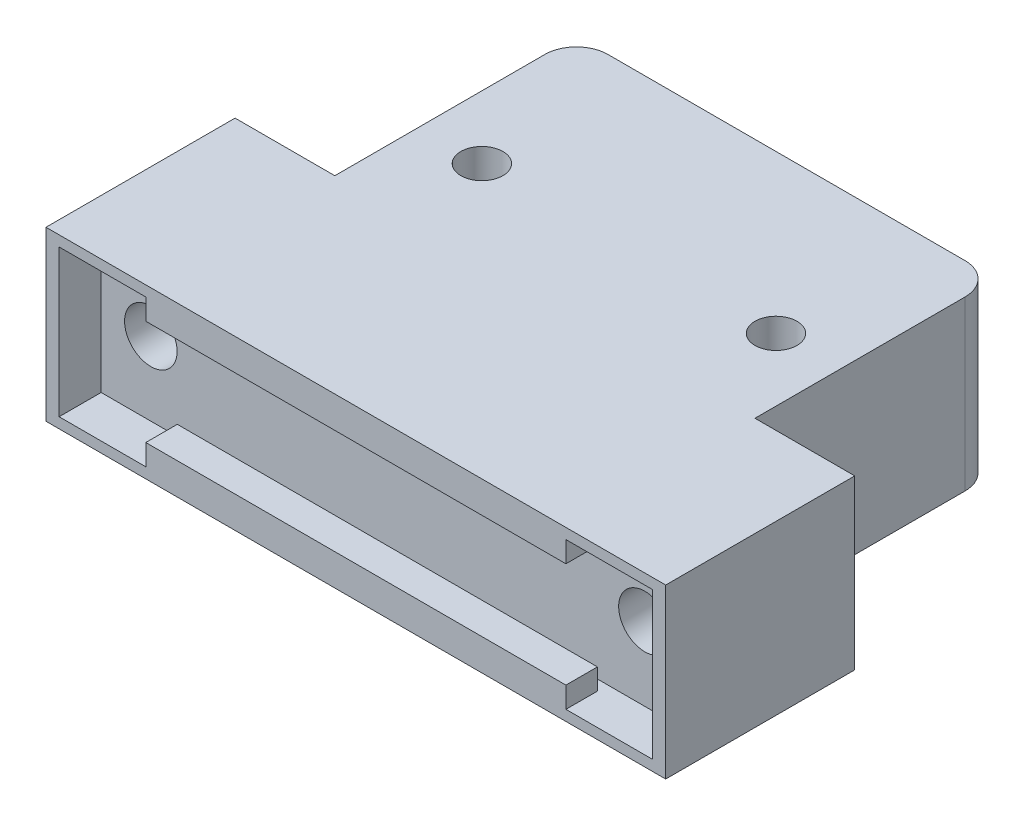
from build123d import *

# Parameters (mm, degrees)
BOSS_EXTRUDE1_DEPTH = 8
SKETCH3_W           = 56.5
SKETCH3_H           = 14
CUT_EXTRUDE1_DEPTH  = 4
SKETCH4_R           = 2.5
CUT_EXTRUDE2_DEPTH  = 48.992186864
SKETCH6_W           = 40
SKETCH6_H           = 3
BOSS_EXTRUDE2_DEPTH = 2
FILLET1_R           = 3
SKETCH7_R           = 2
CUT_EXTRUDE3_DEPTH  = 41.684763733


with BuildPart() as part:
    # Sketch2 → Boss-Extrude1 (new, symmetric)
    with BuildSketch(Plane(origin=(0, 0, 0), x_dir=(1, 0, 0), z_dir=(0, 1, 0))):
        Polygon((20, 23), (-20, 23), (-20, 0), (-29.5, 0), (-29.5, -18), (29.5, -18), (29.5, 0), (20, 0), align=None)
    extrude(amount=BOSS_EXTRUDE1_DEPTH, both=True)

    # Sketch3 → Cut-Extrude1 (cut)
    with BuildSketch(Plane.XY.offset(18)):
        Rectangle(SKETCH3_W, SKETCH3_H)
    extrude(amount=-CUT_EXTRUDE1_DEPTH, mode=Mode.SUBTRACT)

    # Sketch4 → Cut-Extrude2 (cut, through all)
    with BuildSketch(Plane.XY.offset(14)):
        with Locations((-23.52, 0)):
            Circle(SKETCH4_R)
    cut_extrude2 = extrude(amount=-CUT_EXTRUDE2_DEPTH, mode=Mode.SUBTRACT)

    # Mirror1: Cut-Extrude2 across plane
    add(cut_extrude2.mirror(Plane(origin=(0, 0, 0), x_dir=(0, 0, 1), z_dir=(1, 0, 0))), mode=Mode.SUBTRACT)

    # Sketch6 → Boss-Extrude2 (add)
    with BuildSketch(Plane(origin=(0, -7, 0), x_dir=(1, 0, 0), z_dir=(0, 1, 0))):
        with Locations((0, -16.5)):
            Rectangle(SKETCH6_W, SKETCH6_H)
    boss_extrude2 = extrude(amount=BOSS_EXTRUDE2_DEPTH)

    # Mirror2: Boss-Extrude2 across plane
    add(boss_extrude2.mirror(Plane.ZX))

    # Fillet1
    fillet1_edges = [part.edges().sort_by_distance(p)[0] for p in [
        (-20, 0, -23),
        (20, 0, -23),
    ]]
    fillet(fillet1_edges, radius=FILLET1_R)

    # Sketch7 → Cut-Extrude3 (cut, through all)
    with BuildSketch(Plane(origin=(0, 8, 0), x_dir=(1, 0, 0), z_dir=(0, 1, 0))):
        with Locations(Location((-14, 8, 0), (0, 0, 270))):
            Circle(SKETCH7_R)
    cut_extrude3 = extrude(amount=-CUT_EXTRUDE3_DEPTH, mode=Mode.SUBTRACT)

    # Mirror3: Cut-Extrude3 across plane
    add(cut_extrude3.mirror(Plane(origin=(0, 0, 0), x_dir=(0, 0, 1), z_dir=(1, 0, 0))), mode=Mode.SUBTRACT)


solid = part.part
